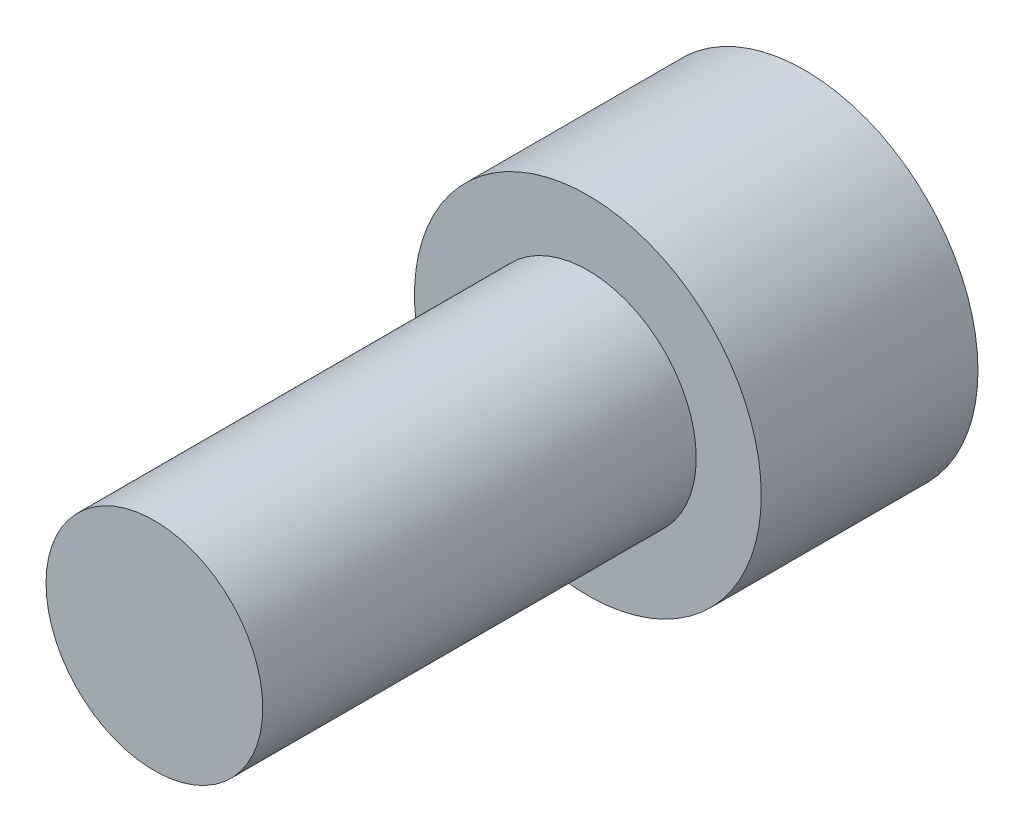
ISO-10303-21;
HEADER;
FILE_DESCRIPTION(('STEP AP214'),'2;1');
FILE_NAME('part.step','',(''),(''),'','','');
FILE_SCHEMA(('AUTOMOTIVE_DESIGN { 1 0 10303 214 1 1 1 1 }'));
ENDSEC;
DATA;
#1=APPLICATION_CONTEXT('core data for automotive mechanical design processes');
#2=APPLICATION_PROTOCOL_DEFINITION('international standard','automotive_design',2000,#1);
#3=PRODUCT_CONTEXT('',#1,'mechanical');
#4=PRODUCT('Part','Part','',(#3));
#5=PRODUCT_RELATED_PRODUCT_CATEGORY('part','',(#4));
#6=PRODUCT_DEFINITION_FORMATION('','',#4);
#7=PRODUCT_DEFINITION_CONTEXT('part definition',#1,'design');
#8=PRODUCT_DEFINITION('design','',#6,#7);
#9=PRODUCT_DEFINITION_SHAPE('','',#8);
#10=(LENGTH_UNIT() NAMED_UNIT(*) SI_UNIT(.MILLI.,.METRE.));
#11=(NAMED_UNIT(*) PLANE_ANGLE_UNIT() SI_UNIT($,.RADIAN.));
#12=(NAMED_UNIT(*) SI_UNIT($,.STERADIAN.) SOLID_ANGLE_UNIT());
#13=UNCERTAINTY_MEASURE_WITH_UNIT(LENGTH_MEASURE(1.E-05),#10,'distance_accuracy_value','');
#14=(GEOMETRIC_REPRESENTATION_CONTEXT(3) GLOBAL_UNCERTAINTY_ASSIGNED_CONTEXT((#13)) GLOBAL_UNIT_ASSIGNED_CONTEXT((#10,
#11,#12)) REPRESENTATION_CONTEXT('',''));
#15=CARTESIAN_POINT('',(0.,0.,0.));
#16=DIRECTION('',(0.,0.,1.));
#17=DIRECTION('',(1.,0.,0.));
#18=AXIS2_PLACEMENT_3D('',#15,#16,#17);
#19=CARTESIAN_POINT('',(0.,0.,20.));
#20=DIRECTION('',(0.,0.,1.));
#21=DIRECTION('',(1.,0.,0.));
#22=AXIS2_PLACEMENT_3D('',#19,#20,#21);
#23=PLANE('',#22);
#24=CARTESIAN_POINT('',(0.,0.,20.));
#25=DIRECTION('',(0.,0.,1.));
#26=DIRECTION('',(1.,0.,0.));
#27=AXIS2_PLACEMENT_3D('',#24,#25,#26);
#28=CIRCLE('',#27,5.);
#29=CARTESIAN_POINT('',(5.,0.,20.));
#30=VERTEX_POINT('',#29);
#31=EDGE_CURVE('E11',#30,#30,#28,.T.);
#32=ORIENTED_EDGE('',*,*,#31,.T.);
#33=EDGE_LOOP('',(#32));
#34=FACE_BOUND('',#33,.T.);
#35=ADVANCED_FACE('F32',(#34),#23,.T.);
#36=CARTESIAN_POINT('',(0.,0.,20.));
#37=DIRECTION('',(0.,0.,1.));
#38=DIRECTION('',(1.,0.,0.));
#39=AXIS2_PLACEMENT_3D('',#36,#37,#38);
#40=CYLINDRICAL_SURFACE('',#39,5.);
#41=CARTESIAN_POINT('',(0.,0.,0.));
#42=DIRECTION('',(0.,0.,1.));
#43=DIRECTION('',(1.,0.,0.));
#44=AXIS2_PLACEMENT_3D('',#41,#42,#43);
#45=CIRCLE('',#44,5.);
#46=CARTESIAN_POINT('',(5.,0.,0.));
#47=VERTEX_POINT('',#46);
#48=EDGE_CURVE('E39',#47,#47,#45,.T.);
#49=ORIENTED_EDGE('',*,*,#48,.T.);
#50=EDGE_LOOP('',(#49));
#51=FACE_BOUND('',#50,.T.);
#52=ORIENTED_EDGE('',*,*,#31,.F.);
#53=EDGE_LOOP('',(#52));
#54=FACE_BOUND('',#53,.T.);
#55=ADVANCED_FACE('F146',(#51,#54),#40,.T.);
#56=CARTESIAN_POINT('',(0.,-5.,0.));
#57=DIRECTION('',(0.,0.,1.));
#58=DIRECTION('',(1.,0.,0.));
#59=AXIS2_PLACEMENT_3D('',#56,#57,#58);
#60=PLANE('',#59);
#61=CARTESIAN_POINT('',(0.,0.,0.));
#62=DIRECTION('',(0.,0.,1.));
#63=DIRECTION('',(1.,0.,0.));
#64=AXIS2_PLACEMENT_3D('',#61,#62,#63);
#65=CIRCLE('',#64,8.);
#66=CARTESIAN_POINT('',(8.,0.,0.));
#67=VERTEX_POINT('',#66);
#68=EDGE_CURVE('E141',#67,#67,#65,.T.);
#69=ORIENTED_EDGE('',*,*,#68,.T.);
#70=EDGE_LOOP('',(#69));
#71=FACE_BOUND('',#70,.T.);
#72=ORIENTED_EDGE('',*,*,#48,.F.);
#73=EDGE_LOOP('',(#72));
#74=FACE_BOUND('',#73,.T.);
#75=ADVANCED_FACE('F149',(#71,#74),#60,.T.);
#76=CARTESIAN_POINT('',(0.,0.,20.));
#77=DIRECTION('',(0.,0.,1.));
#78=DIRECTION('',(1.,0.,0.));
#79=AXIS2_PLACEMENT_3D('',#76,#77,#78);
#80=CYLINDRICAL_SURFACE('',#79,8.);
#81=CARTESIAN_POINT('',(0.,0.,-10.));
#82=DIRECTION('',(0.,0.,1.));
#83=DIRECTION('',(1.,0.,0.));
#84=AXIS2_PLACEMENT_3D('',#81,#82,#83);
#85=CIRCLE('',#84,8.);
#86=CARTESIAN_POINT('',(8.,0.,-10.));
#87=VERTEX_POINT('',#86);
#88=EDGE_CURVE('E133',#87,#87,#85,.T.);
#89=ORIENTED_EDGE('',*,*,#88,.T.);
#90=EDGE_LOOP('',(#89));
#91=FACE_BOUND('',#90,.T.);
#92=ORIENTED_EDGE('',*,*,#68,.F.);
#93=EDGE_LOOP('',(#92));
#94=FACE_BOUND('',#93,.T.);
#95=ADVANCED_FACE('F151',(#91,#94),#80,.T.);
#96=CARTESIAN_POINT('',(0.,-8.,-10.));
#97=DIRECTION('',(0.,0.,-1.));
#98=DIRECTION('',(-1.,0.,0.));
#99=AXIS2_PLACEMENT_3D('',#96,#97,#98);
#100=PLANE('',#99);
#101=DIRECTION('',(0.866025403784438,-0.5,0.));
#102=VECTOR('',#101,1.);
#103=CARTESIAN_POINT('',(0.,4.61880215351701,-10.));
#104=LINE('',#103,#102);
#105=CARTESIAN_POINT('',(0.,4.61880215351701,-10.));
#106=VERTEX_POINT('',#105);
#107=CARTESIAN_POINT('',(4.,2.3094010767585,-10.));
#108=VERTEX_POINT('',#107);
#109=EDGE_CURVE('E46',#106,#108,#104,.T.);
#110=ORIENTED_EDGE('',*,*,#109,.F.);
#111=DIRECTION('',(0.866025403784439,0.5,0.));
#112=VECTOR('',#111,1.);
#113=CARTESIAN_POINT('',(-4.,2.3094010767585,-10.));
#114=LINE('',#113,#112);
#115=CARTESIAN_POINT('',(-4.,2.3094010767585,-10.));
#116=VERTEX_POINT('',#115);
#117=EDGE_CURVE('E129',#116,#106,#114,.T.);
#118=ORIENTED_EDGE('',*,*,#117,.F.);
#119=DIRECTION('',(0.,1.,0.));
#120=VECTOR('',#119,1.);
#121=CARTESIAN_POINT('',(-4.,-2.3094010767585,-10.));
#122=LINE('',#121,#120);
#123=CARTESIAN_POINT('',(-4.,-2.3094010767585,-10.));
#124=VERTEX_POINT('',#123);
#125=EDGE_CURVE('E127',#124,#116,#122,.T.);
#126=ORIENTED_EDGE('',*,*,#125,.F.);
#127=DIRECTION('',(-0.866025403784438,0.5,0.));
#128=VECTOR('',#127,1.);
#129=CARTESIAN_POINT('',(0.,-4.61880215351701,-10.));
#130=LINE('',#129,#128);
#131=CARTESIAN_POINT('',(0.,-4.61880215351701,-10.));
#132=VERTEX_POINT('',#131);
#133=EDGE_CURVE('E94',#132,#124,#130,.T.);
#134=ORIENTED_EDGE('',*,*,#133,.F.);
#135=DIRECTION('',(-0.866025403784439,-0.5,0.));
#136=VECTOR('',#135,1.);
#137=CARTESIAN_POINT('',(4.,-2.3094010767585,-10.));
#138=LINE('',#137,#136);
#139=CARTESIAN_POINT('',(4.,-2.3094010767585,-10.));
#140=VERTEX_POINT('',#139);
#141=EDGE_CURVE('E123',#140,#132,#138,.T.);
#142=ORIENTED_EDGE('',*,*,#141,.F.);
#143=DIRECTION('',(0.,-1.,0.));
#144=VECTOR('',#143,1.);
#145=CARTESIAN_POINT('',(4.,2.3094010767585,-10.));
#146=LINE('',#145,#144);
#147=EDGE_CURVE('E120',#108,#140,#146,.T.);
#148=ORIENTED_EDGE('',*,*,#147,.F.);
#149=EDGE_LOOP('',(#110,#118,#126,#134,#142,#148));
#150=FACE_BOUND('',#149,.T.);
#151=ORIENTED_EDGE('',*,*,#88,.F.);
#152=EDGE_LOOP('',(#151));
#153=FACE_BOUND('',#152,.T.);
#154=ADVANCED_FACE('F158',(#150,#153),#100,.T.);
#155=CARTESIAN_POINT('',(0.,4.61880215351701,-2.));
#156=DIRECTION('',(0.5,0.866025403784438,0.));
#157=DIRECTION('',(-0.866025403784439,0.5,0.));
#158=AXIS2_PLACEMENT_3D('',#155,#156,#157);
#159=PLANE('',#158);
#160=ORIENTED_EDGE('',*,*,#109,.T.);
#161=DIRECTION('',(0.,0.,-1.));
#162=VECTOR('',#161,1.);
#163=CARTESIAN_POINT('',(4.,2.3094010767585,-2.));
#164=LINE('',#163,#162);
#165=CARTESIAN_POINT('',(4.,2.3094010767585,-2.));
#166=VERTEX_POINT('',#165);
#167=EDGE_CURVE('E76',#166,#108,#164,.T.);
#168=ORIENTED_EDGE('',*,*,#167,.F.);
#169=DIRECTION('',(0.866025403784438,-0.5,0.));
#170=VECTOR('',#169,1.);
#171=CARTESIAN_POINT('',(0.,4.61880215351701,-2.));
#172=LINE('',#171,#170);
#173=CARTESIAN_POINT('',(0.,4.61880215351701,-2.));
#174=VERTEX_POINT('',#173);
#175=EDGE_CURVE('E131',#174,#166,#172,.T.);
#176=ORIENTED_EDGE('',*,*,#175,.F.);
#177=DIRECTION('',(0.,0.,-1.));
#178=VECTOR('',#177,1.);
#179=CARTESIAN_POINT('',(0.,4.61880215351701,-2.));
#180=LINE('',#179,#178);
#181=EDGE_CURVE('E54',#174,#106,#180,.T.);
#182=ORIENTED_EDGE('',*,*,#181,.T.);
#183=EDGE_LOOP('',(#160,#168,#176,#182));
#184=FACE_BOUND('',#183,.T.);
#185=ADVANCED_FACE('F189',(#184),#159,.F.);
#186=CARTESIAN_POINT('',(-4.,2.3094010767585,-2.));
#187=DIRECTION('',(-0.5,0.866025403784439,0.));
#188=DIRECTION('',(-0.866025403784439,-0.5,0.));
#189=AXIS2_PLACEMENT_3D('',#186,#187,#188);
#190=PLANE('',#189);
#191=ORIENTED_EDGE('',*,*,#117,.T.);
#192=ORIENTED_EDGE('',*,*,#181,.F.);
#193=DIRECTION('',(0.866025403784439,0.5,0.));
#194=VECTOR('',#193,1.);
#195=CARTESIAN_POINT('',(-4.,2.3094010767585,-2.));
#196=LINE('',#195,#194);
#197=CARTESIAN_POINT('',(-4.,2.3094010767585,-2.));
#198=VERTEX_POINT('',#197);
#199=EDGE_CURVE('E106',#198,#174,#196,.T.);
#200=ORIENTED_EDGE('',*,*,#199,.F.);
#201=DIRECTION('',(0.,0.,-1.));
#202=VECTOR('',#201,1.);
#203=CARTESIAN_POINT('',(-4.,2.3094010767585,-2.));
#204=LINE('',#203,#202);
#205=EDGE_CURVE('E98',#198,#116,#204,.T.);
#206=ORIENTED_EDGE('',*,*,#205,.T.);
#207=EDGE_LOOP('',(#191,#192,#200,#206));
#208=FACE_BOUND('',#207,.T.);
#209=ADVANCED_FACE('F199',(#208),#190,.F.);
#210=CARTESIAN_POINT('',(-4.,-2.3094010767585,-2.));
#211=DIRECTION('',(-1.,0.,0.));
#212=DIRECTION('',(0.,0.,1.));
#213=AXIS2_PLACEMENT_3D('',#210,#211,#212);
#214=PLANE('',#213);
#215=ORIENTED_EDGE('',*,*,#125,.T.);
#216=ORIENTED_EDGE('',*,*,#205,.F.);
#217=DIRECTION('',(0.,1.,0.));
#218=VECTOR('',#217,1.);
#219=CARTESIAN_POINT('',(-4.,-2.3094010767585,-2.));
#220=LINE('',#219,#218);
#221=CARTESIAN_POINT('',(-4.,-2.3094010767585,-2.));
#222=VERTEX_POINT('',#221);
#223=EDGE_CURVE('E102',#222,#198,#220,.T.);
#224=ORIENTED_EDGE('',*,*,#223,.F.);
#225=DIRECTION('',(0.,0.,-1.));
#226=VECTOR('',#225,1.);
#227=CARTESIAN_POINT('',(-4.,-2.3094010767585,-2.));
#228=LINE('',#227,#226);
#229=EDGE_CURVE('E87',#222,#124,#228,.T.);
#230=ORIENTED_EDGE('',*,*,#229,.T.);
#231=EDGE_LOOP('',(#215,#216,#224,#230));
#232=FACE_BOUND('',#231,.T.);
#233=ADVANCED_FACE('F103',(#232),#214,.F.);
#234=CARTESIAN_POINT('',(0.,-4.61880215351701,-2.));
#235=DIRECTION('',(-0.5,-0.866025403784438,0.));
#236=DIRECTION('',(0.866025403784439,-0.5,0.));
#237=AXIS2_PLACEMENT_3D('',#234,#235,#236);
#238=PLANE('',#237);
#239=ORIENTED_EDGE('',*,*,#133,.T.);
#240=ORIENTED_EDGE('',*,*,#229,.F.);
#241=DIRECTION('',(-0.866025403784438,0.5,0.));
#242=VECTOR('',#241,1.);
#243=CARTESIAN_POINT('',(0.,-4.61880215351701,-2.));
#244=LINE('',#243,#242);
#245=CARTESIAN_POINT('',(0.,-4.61880215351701,-2.));
#246=VERTEX_POINT('',#245);
#247=EDGE_CURVE('E91',#246,#222,#244,.T.);
#248=ORIENTED_EDGE('',*,*,#247,.F.);
#249=DIRECTION('',(0.,0.,-1.));
#250=VECTOR('',#249,1.);
#251=CARTESIAN_POINT('',(0.,-4.61880215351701,-2.));
#252=LINE('',#251,#250);
#253=EDGE_CURVE('E99',#246,#132,#252,.T.);
#254=ORIENTED_EDGE('',*,*,#253,.T.);
#255=EDGE_LOOP('',(#239,#240,#248,#254));
#256=FACE_BOUND('',#255,.T.);
#257=ADVANCED_FACE('F89',(#256),#238,.F.);
#258=CARTESIAN_POINT('',(4.,-2.3094010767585,-2.));
#259=DIRECTION('',(0.5,-0.866025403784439,0.));
#260=DIRECTION('',(0.866025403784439,0.5,0.));
#261=AXIS2_PLACEMENT_3D('',#258,#259,#260);
#262=PLANE('',#261);
#263=ORIENTED_EDGE('',*,*,#141,.T.);
#264=ORIENTED_EDGE('',*,*,#253,.F.);
#265=DIRECTION('',(-0.866025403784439,-0.5,0.));
#266=VECTOR('',#265,1.);
#267=CARTESIAN_POINT('',(4.,-2.3094010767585,-2.));
#268=LINE('',#267,#266);
#269=CARTESIAN_POINT('',(4.,-2.3094010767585,-2.));
#270=VERTEX_POINT('',#269);
#271=EDGE_CURVE('E112',#270,#246,#268,.T.);
#272=ORIENTED_EDGE('',*,*,#271,.F.);
#273=DIRECTION('',(0.,0.,-1.));
#274=VECTOR('',#273,1.);
#275=CARTESIAN_POINT('',(4.,-2.3094010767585,-2.));
#276=LINE('',#275,#274);
#277=EDGE_CURVE('E136',#270,#140,#276,.T.);
#278=ORIENTED_EDGE('',*,*,#277,.T.);
#279=EDGE_LOOP('',(#263,#264,#272,#278));
#280=FACE_BOUND('',#279,.T.);
#281=ADVANCED_FACE('F224',(#280),#262,.F.);
#282=CARTESIAN_POINT('',(4.,2.3094010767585,-2.));
#283=DIRECTION('',(1.,0.,0.));
#284=DIRECTION('',(0.,0.,-1.));
#285=AXIS2_PLACEMENT_3D('',#282,#283,#284);
#286=PLANE('',#285);
#287=ORIENTED_EDGE('',*,*,#147,.T.);
#288=ORIENTED_EDGE('',*,*,#277,.F.);
#289=DIRECTION('',(0.,-1.,0.));
#290=VECTOR('',#289,1.);
#291=CARTESIAN_POINT('',(4.,2.3094010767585,-2.));
#292=LINE('',#291,#290);
#293=EDGE_CURVE('E114',#166,#270,#292,.T.);
#294=ORIENTED_EDGE('',*,*,#293,.F.);
#295=ORIENTED_EDGE('',*,*,#167,.T.);
#296=EDGE_LOOP('',(#287,#288,#294,#295));
#297=FACE_BOUND('',#296,.T.);
#298=ADVANCED_FACE('F233',(#297),#286,.F.);
#299=CARTESIAN_POINT('',(8.,0.,-2.));
#300=DIRECTION('',(0.,0.,-1.));
#301=DIRECTION('',(-1.,0.,0.));
#302=AXIS2_PLACEMENT_3D('',#299,#300,#301);
#303=PLANE('',#302);
#304=ORIENTED_EDGE('',*,*,#175,.T.);
#305=ORIENTED_EDGE('',*,*,#293,.T.);
#306=ORIENTED_EDGE('',*,*,#271,.T.);
#307=ORIENTED_EDGE('',*,*,#247,.T.);
#308=ORIENTED_EDGE('',*,*,#223,.T.);
#309=ORIENTED_EDGE('',*,*,#199,.T.);
#310=EDGE_LOOP('',(#304,#305,#306,#307,#308,#309));
#311=FACE_BOUND('',#310,.T.);
#312=ADVANCED_FACE('F109',(#311),#303,.T.);
#313=CLOSED_SHELL('',(#35,#55,#75,#95,#154,#185,#209,#233,#257,#281,#298,#312));
#314=MANIFOLD_SOLID_BREP('B2',#313);
#315=ADVANCED_BREP_SHAPE_REPRESENTATION('',(#18,#314),#14);
#316=SHAPE_DEFINITION_REPRESENTATION(#9,#315);
ENDSEC;
END-ISO-10303-21;
